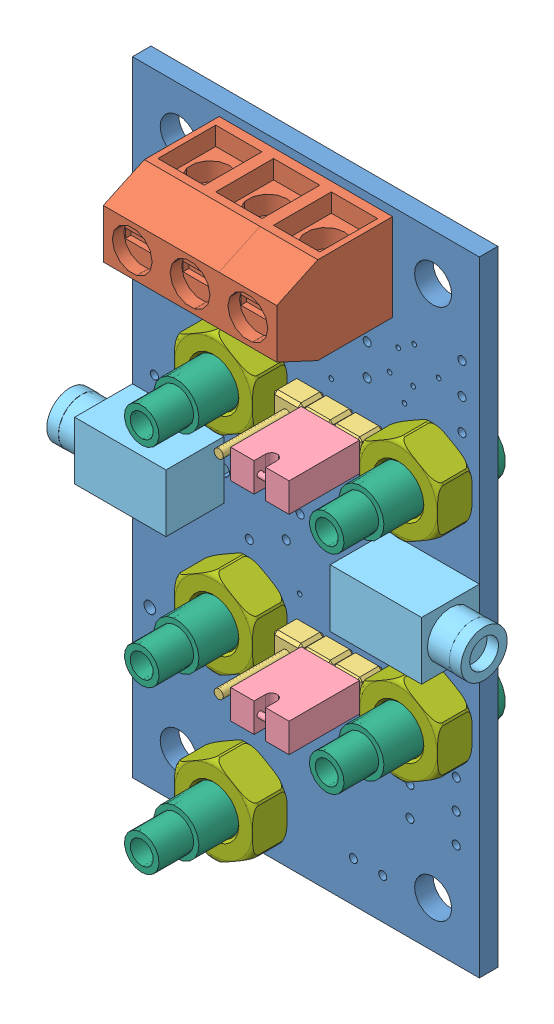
SolidWorks assembly Module K-AP-MMAV pour pinces crocodiles.SLDASM, configuration Défaut (file format 5000). Lengths in mm.
Overall size (35.82 54 15.02).
24 component instances, 7 part files, 35 mates.
Components (placement in the parent):
- CI AP-LOG-1: CI AP-LOG.SLDPRT [Défaut] at (-19.3466 -28.0187 -0.8) size (30 54 1.6)
- BORNIER 3-1: BORNIER 3.SLDPRT [Default] at (3.1534 25.2558 0.8) x (-1 0 0) z (0 0 1) size (15 7.55 15.02)
- ASB 3PICOTS avec capuchon-1: ASB 3PICOTS avec capuchon.SLDASM [Default] at (-3.7407 -9.3519 4.903) x (-1 0 0) z (0 0 -1) size (7.59 2.51 10.25)
  - PICOT-1: PICOT.SLDPRT [Default] at (26.8516 -23.7306 1.953) size (2.51 2.51 10)
  - PICOT-2: PICOT.SLDPRT [Default] at (29.3916 -23.7306 1.953) size (2.51 2.51 10)
  - PICOT-3: PICOT.SLDPRT [Default] at (24.3116 -23.7306 1.953) size (2.51 2.51 10)
  - Capuchon picot-1: Capuchon picot.SLDPRT [Défaut] at (-6.1888 -1.9209 1.953) size (5.05 2.51 6.1)
- ASB 3PICOTS avec capuchon-2: ASB 3PICOTS avec capuchon.SLDASM [Default] at (-3.7407 8.6466 4.903) x (-1 0 0) z (0 0 -1) size (7.59 2.51 10.25)
  - PICOT-1: PICOT.SLDPRT [Default] at (26.8516 -23.7306 1.953) size (2.51 2.51 10)
  - PICOT-2: PICOT.SLDPRT [Default] at (29.3916 -23.7306 1.953) size (2.51 2.51 10)
  - PICOT-3: PICOT.SLDPRT [Default] at (24.3116 -23.7306 1.953) size (2.51 2.51 10)
  - Capuchon picot-1: Capuchon picot.SLDPRT [Défaut] at (-6.1888 -1.9209 1.953) size (5.05 2.51 6.1)
- Embase jack 2.5-1: Embase jack 2.5.SLDPRT [Défaut] at (-19.3472 -1.0185 0.8) x (1 0 0) z (0 -1 0) size (10.81 8.01 5)
- Embase jack 2.5-2: Embase jack 2.5.SLDPRT [Défaut] at (10.6548 -1.0185 0.8) x (-1 0 0) z (0 1 0) size (10.81 8.01 5)
- Connecteur banane-1: Connecteur banane.SLDPRT [Défaut] at (-9.3466 -24.0182 10) x (0.930683 -0.365827 0) z (0.365827 0.930683 0) size (4.9 13 4.9)
- Ecrou M4-1: Ecrou M4.SLDPRT [Défaut] at (-9.3466 -24.0182 0.8) size (6.84 7.97 3.43)
- Ecrou M4-2: Ecrou M4.SLDPRT [Défaut] at (6.6529 -10.0177 0.8) size (6.84 7.97 3.43)
- Ecrou M4-3: Ecrou M4.SLDPRT [Défaut] at (6.6529 7.9807 0.8) size (6.84 7.97 3.43)
- Ecrou M4-4: Ecrou M4.SLDPRT [Défaut] at (-9.3466 7.9807 0.8) size (6.84 7.97 3.43)
- Ecrou M4-5: Ecrou M4.SLDPRT [Défaut] at (-9.3466 -10.0177 0.8) size (6.84 7.97 3.43)
- Connecteur banane-2: Connecteur banane.SLDPRT [Défaut] at (6.6529 -10.0177 10) x (0.930683 -0.365827 0) z (0.365827 0.930683 0) size (4.9 13 4.9)
- Connecteur banane-3: Connecteur banane.SLDPRT [Défaut] at (-9.3466 -10.0177 10) x (0.930683 -0.365827 0) z (0.365827 0.930683 0) size (4.9 13 4.9)
- Connecteur banane-4: Connecteur banane.SLDPRT [Défaut] at (6.6529 7.9807 10) x (0.930683 -0.365827 0) z (0.365827 0.930683 0) size (4.9 13 4.9)
- Connecteur banane-5: Connecteur banane.SLDPRT [Défaut] at (-9.3466 7.9807 10) x (0.930683 -0.365827 0) z (0.365827 0.930683 0) size (4.9 13 4.9)
Mates (geometry in assembly coordinates):
- Coïncidente1: coincident anti-aligned: axis of CI AP-LOG-1 through (0.6534 21.4808 0.8) axis (0 0 -1); axis of BORNIER 3-1 through (0.6534 21.4808 -3.7) axis (0 0 1)
- Coïncidente2: coincident anti-aligned: axis of CI AP-LOG-1 through (-9.3466 21.4808 0.8) axis (0 0 -1); axis of BORNIER 3-1 through (-9.3466 21.4808 -3.7) axis (0 0 1)
- Coïncidente3: coincident anti-aligned: plane of CI AP-LOG-1 through (-19.3466 -28.0187 0.8) normal (0 0 1); plane of BORNIER 3-1 through (3.1534 25.2558 0.8) normal (0 0 -1)
- Coïncidente4: coincident anti-aligned: axis of CI AP-LOG-1 through (1.1931 -10.0177 0.8) axis (0 0 -1); axis of ASB 3PICOTS avec capuchon-1/PICOT-3 through (1.1931 -10.0177 -1.2) axis (0 0 1)
- Coïncidente5: coincident anti-aligned: axis of CI AP-LOG-1 through (-3.8869 -10.0177 0.8) axis (0 0 -1); axis of ASB 3PICOTS avec capuchon-1/PICOT-2 through (-3.8869 -10.0177 -1.2) axis (0 0 1)
- Coïncidente6: coincident anti-aligned: plane of CI AP-LOG-1 through (-19.3466 -28.0187 0.8) normal (0 0 1); plane of ASB 3PICOTS avec capuchon-1/PICOT-1 through (-0.0919 -11.2727 0.8) normal (0 0 -1)
- Coïncidente7: coincident anti-aligned: axis of CI AP-LOG-1 through (1.1931 7.9807 0.8) axis (0 0 -1); axis of ASB 3PICOTS avec capuchon-2/PICOT-3 through (1.1931 7.9807 -1.2) axis (0 0 1)
- Coïncidente8: coincident anti-aligned: axis of CI AP-LOG-1 through (-3.8869 7.9807 0.8) axis (0 0 -1); axis of ASB 3PICOTS avec capuchon-2/PICOT-2 through (-3.8869 7.9807 -1.2) axis (0 0 1)
- Coïncidente9: coincident anti-aligned: plane of CI AP-LOG-1 through (-19.3466 -28.0187 0.8) normal (0 0 1); plane of ASB 3PICOTS avec capuchon-2/PICOT-2 through (-2.6319 6.7257 0.8) normal (0 0 -1)
- Coïncidente10: coincident anti-aligned: axis of CI AP-LOG-1 through (-15.8472 -1.0185 0.8) axis (0 0 -1); axis of Embase jack 2.5-1 through (-15.8472 -1.0185 -1.2) axis (0 0 1)
- Parallèle1: parallel aligned: plane of CI AP-LOG-1 through (-19.3466 25.9813 0.8) normal (-1 0 0); plane of Embase jack 2.5-1 through (-19.3472 1.4815 5.8) normal (-1 0 0)
- Coïncidente12: coincident anti-aligned: plane of CI AP-LOG-1 through (-19.3466 -28.0187 0.8) normal (0 0 1); plane of Embase jack 2.5-1 through (-19.3472 -3.5185 0.8) normal (0 0 -1)
- Coïncidente13: coincident anti-aligned: axis of CI AP-LOG-1 through (7.1548 -1.0185 0.8) axis (0 0 -1); axis of Embase jack 2.5-2 through (7.1548 -1.0185 -1.2) axis (0 0 1)
- Parallèle2: parallel aligned: plane of CI AP-LOG-1 through (10.6534 25.9813 0.8) normal (1 0 0); plane of Embase jack 2.5-2 through (10.6548 -3.5185 5.8) normal (1 0 0)
- Coïncidente15: coincident anti-aligned: plane of CI AP-LOG-1 through (-19.3466 -28.0187 0.8) normal (0 0 1); plane of Embase jack 2.5-2 through (10.6548 1.4815 0.8) normal (0 0 -1)
- Coïncidente16: coincident anti-aligned: axis of CI AP-LOG-1 through (-9.3466 -24.0182 0.8) axis (0 0 -1); axis of Connecteur banane-1 through (-9.3466 -24.0182 7) axis (0 0 1)
- Coïncidente17: coincident anti-aligned: plane of CI AP-LOG-1 through (-19.3466 -28.0187 -0.8) normal (0 0 -1); circle of Connecteur banane-1
- Coïncidente18: coincident anti-aligned: axis of CI AP-LOG-1 through (6.6529 -10.0177 0.8) axis (0 0 -1); axis of Connecteur banane-2 through (6.6529 -10.0177 7) axis (0 0 1)
- Coïncidente19: coincident anti-aligned: plane of CI AP-LOG-1 through (-19.3466 -28.0187 -0.8) normal (0 0 -1); circle of Connecteur banane-2
- Coïncidente20: coincident anti-aligned: axis of CI AP-LOG-1 through (-9.3466 -10.0177 0.8) axis (0 0 -1); axis of Connecteur banane-3 through (-9.3466 -10.0177 7) axis (0 0 1)
- Coïncidente21: coincident anti-aligned: plane of CI AP-LOG-1 through (-19.3466 -28.0187 -0.8) normal (0 0 -1); circle of Connecteur banane-3
- Coïncidente22: coincident anti-aligned: axis of CI AP-LOG-1 through (6.6529 7.9807 0.8) axis (0 0 -1); axis of Connecteur banane-4 through (6.6529 7.9807 7) axis (0 0 1)
- Coïncidente23: coincident anti-aligned: plane of CI AP-LOG-1 through (-19.3466 -28.0187 -0.8) normal (0 0 -1); circle of Connecteur banane-4
- Coïncidente24: coincident anti-aligned: axis of CI AP-LOG-1 through (-9.3466 7.9807 0.8) axis (0 0 -1); axis of Connecteur banane-5 through (-9.3466 7.9807 7) axis (0 0 1)
- Coïncidente25: coincident anti-aligned: plane of CI AP-LOG-1 through (-19.3466 -28.0187 -0.8) normal (0 0 -1); circle of Connecteur banane-5
- Coïncidente26: coincident anti-aligned: axis of Connecteur banane-1 through (-9.3466 -24.0182 7) axis (0 0 1); axis of Ecrou M4-1 through (-9.3466 -24.0182 3.3) axis (0 0 -1)
- Coïncidente27: coincident anti-aligned: axis of Ecrou M4-5 through (-9.3466 -10.0177 3.3) axis (0 0 -1); axis of Connecteur banane-3 through (-9.3466 -10.0177 7) axis (0 0 1)
- Coïncidente28: coincident anti-aligned: axis of Ecrou M4-4 through (-9.3466 7.9807 3.3) axis (0 0 -1); axis of Connecteur banane-5 through (-9.3466 7.9807 7) axis (0 0 1)
- Coïncidente29: coincident anti-aligned: axis of Ecrou M4-3 through (6.6529 7.9807 3.3) axis (0 0 -1); axis of Connecteur banane-4 through (6.6529 7.9807 7) axis (0 0 1)
- Coïncidente30: coincident anti-aligned: axis of Ecrou M4-2 through (6.6529 -10.0177 3.3) axis (0 0 -1); axis of Connecteur banane-2 through (6.6529 -10.0177 7) axis (0 0 1)
- Coïncidente31: coincident anti-aligned: plane of CI AP-LOG-1 through (-19.3466 -28.0187 0.8) normal (0 0 1); plane of Ecrou M4-1 through (-9.3466 -24.0182 0.8) normal (0 0 -1)
- Coïncidente32: coincident anti-aligned: plane of CI AP-LOG-1 through (-19.3466 -28.0187 0.8) normal (0 0 1); plane of Ecrou M4-2 through (6.6529 -10.0177 0.8) normal (0 0 -1)
- Coïncidente33: coincident anti-aligned: plane of CI AP-LOG-1 through (-19.3466 -28.0187 0.8) normal (0 0 1); plane of Ecrou M4-5 through (-9.3466 -10.0177 0.8) normal (0 0 -1)
- Coïncidente34: coincident anti-aligned: plane of CI AP-LOG-1 through (-19.3466 -28.0187 0.8) normal (0 0 1); plane of Ecrou M4-3 through (6.6529 7.9807 0.8) normal (0 0 -1)
- Coïncidente35: coincident anti-aligned: plane of CI AP-LOG-1 through (-19.3466 -28.0187 0.8) normal (0 0 1); plane of Ecrou M4-4 through (-9.3466 7.9807 0.8) normal (0 0 -1)
